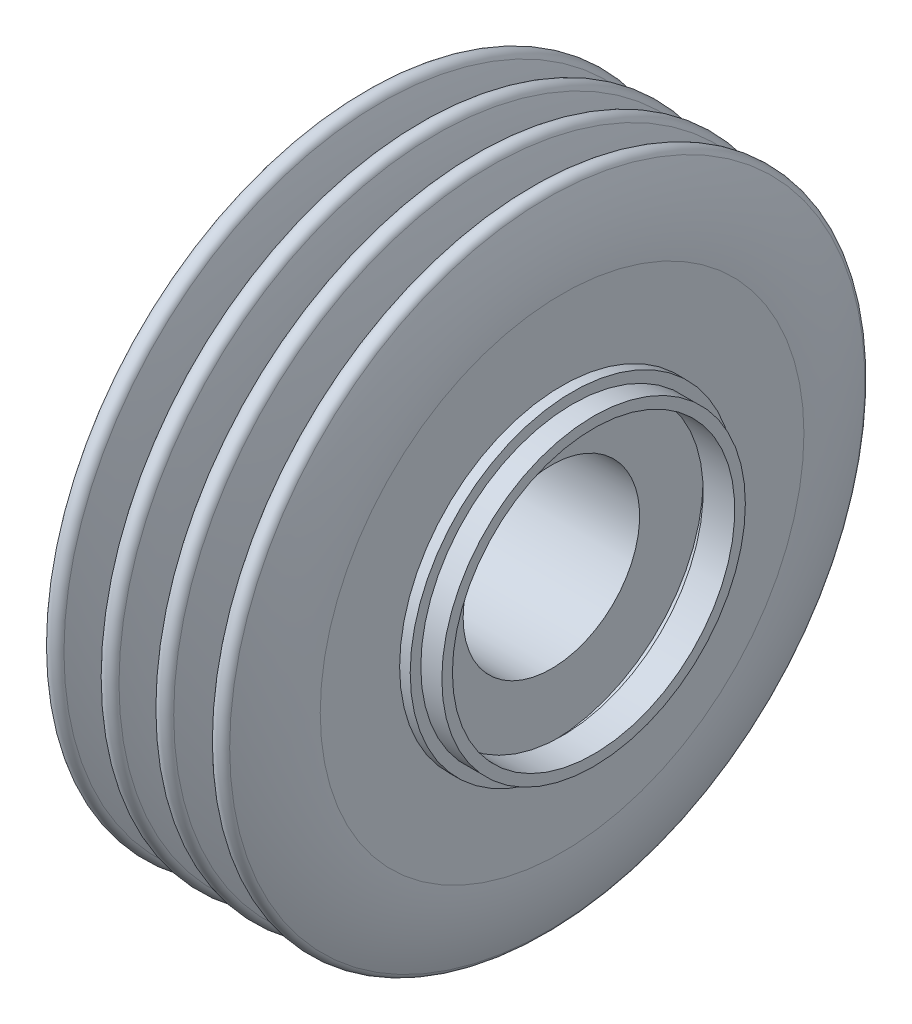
ISO-10303-21;
HEADER;
FILE_DESCRIPTION(('STEP AP214'),'2;1');
FILE_NAME('part.step','',(''),(''),'','','');
FILE_SCHEMA(('AUTOMOTIVE_DESIGN { 1 0 10303 214 1 1 1 1 }'));
ENDSEC;
DATA;
#1=APPLICATION_CONTEXT('core data for automotive mechanical design processes');
#2=APPLICATION_PROTOCOL_DEFINITION('international standard','automotive_design',2000,#1);
#3=PRODUCT_CONTEXT('',#1,'mechanical');
#4=PRODUCT('Part','Part','',(#3));
#5=PRODUCT_RELATED_PRODUCT_CATEGORY('part','',(#4));
#6=PRODUCT_DEFINITION_FORMATION('','',#4);
#7=PRODUCT_DEFINITION_CONTEXT('part definition',#1,'design');
#8=PRODUCT_DEFINITION('design','',#6,#7);
#9=PRODUCT_DEFINITION_SHAPE('','',#8);
#10=(LENGTH_UNIT() NAMED_UNIT(*) SI_UNIT(.MILLI.,.METRE.));
#11=(NAMED_UNIT(*) PLANE_ANGLE_UNIT() SI_UNIT($,.RADIAN.));
#12=(NAMED_UNIT(*) SI_UNIT($,.STERADIAN.) SOLID_ANGLE_UNIT());
#13=UNCERTAINTY_MEASURE_WITH_UNIT(LENGTH_MEASURE(1.E-05),#10,'distance_accuracy_value','');
#14=(GEOMETRIC_REPRESENTATION_CONTEXT(3) GLOBAL_UNCERTAINTY_ASSIGNED_CONTEXT((#13)) GLOBAL_UNIT_ASSIGNED_CONTEXT((#10,
#11,#12)) REPRESENTATION_CONTEXT('',''));
#15=CARTESIAN_POINT('',(0.,0.,0.));
#16=DIRECTION('',(0.,0.,1.));
#17=DIRECTION('',(1.,0.,0.));
#18=AXIS2_PLACEMENT_3D('',#15,#16,#17);
#19=CARTESIAN_POINT('',(82.1513797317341,0.,0.));
#20=DIRECTION('',(1.,0.,0.));
#21=DIRECTION('',(0.,0.,-1.));
#22=AXIS2_PLACEMENT_3D('',#19,#20,#21);
#23=CONICAL_SURFACE('',#22,46.,1.56936773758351);
#24=CARTESIAN_POINT('',(82.1835509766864,0.,0.));
#25=DIRECTION('',(-1.,0.,0.));
#26=DIRECTION('',(0.,0.,1.));
#27=AXIS2_PLACEMENT_3D('',#24,#25,#26);
#28=CIRCLE('',#27,68.519575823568);
#29=CARTESIAN_POINT('',(82.1835509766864,0.,68.519575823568));
#30=VERTEX_POINT('',#29);
#31=EDGE_CURVE('E10',#30,#30,#28,.T.);
#32=ORIENTED_EDGE('',*,*,#31,.F.);
#33=EDGE_LOOP('',(#32));
#34=FACE_BOUND('',#33,.T.);
#35=CARTESIAN_POINT('',(82.1513797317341,0.,0.));
#36=DIRECTION('',(-1.,0.,0.));
#37=DIRECTION('',(0.,0.,1.));
#38=AXIS2_PLACEMENT_3D('',#35,#36,#37);
#39=CIRCLE('',#38,46.);
#40=CARTESIAN_POINT('',(82.1513797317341,0.,46.));
#41=VERTEX_POINT('',#40);
#42=EDGE_CURVE('E139',#41,#41,#39,.T.);
#43=ORIENTED_EDGE('',*,*,#42,.T.);
#44=EDGE_LOOP('',(#43));
#45=FACE_BOUND('',#44,.T.);
#46=ADVANCED_FACE('F33',(#34,#45),#23,.F.);
#47=CARTESIAN_POINT('',(25.5457134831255,0.,0.));
#48=DIRECTION('',(-1.,0.,0.));
#49=DIRECTION('',(0.,0.,1.));
#50=AXIS2_PLACEMENT_3D('',#47,#48,#49);
#51=TOROIDAL_SURFACE('',#50,68.5817409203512,56.6378716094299);
#52=CARTESIAN_POINT('',(77.9846516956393,0.,0.));
#53=DIRECTION('',(-1.,0.,0.));
#54=DIRECTION('',(0.,0.,1.));
#55=AXIS2_PLACEMENT_3D('',#52,#53,#54);
#56=CIRCLE('',#55,89.9828217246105);
#57=CARTESIAN_POINT('',(77.9846516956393,0.,89.9828217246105));
#58=VERTEX_POINT('',#57);
#59=EDGE_CURVE('E39',#58,#58,#56,.T.);
#60=ORIENTED_EDGE('',*,*,#59,.F.);
#61=EDGE_LOOP('',(#60));
#62=FACE_BOUND('',#61,.T.);
#63=ORIENTED_EDGE('',*,*,#31,.T.);
#64=EDGE_LOOP('',(#63));
#65=FACE_BOUND('',#64,.T.);
#66=ADVANCED_FACE('F192',(#62,#65),#51,.T.);
#67=CARTESIAN_POINT('',(75.6699929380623,0.,0.));
#68=DIRECTION('',(-1.,0.,0.));
#69=DIRECTION('',(0.,0.,1.));
#70=AXIS2_PLACEMENT_3D('',#67,#68,#69);
#71=TOROIDAL_SURFACE('',#70,89.0381763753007,2.50000000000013);
#72=CARTESIAN_POINT('',(73.2742645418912,0.,0.));
#73=DIRECTION('',(-1.,0.,0.));
#74=DIRECTION('',(0.,0.,1.));
#75=AXIS2_PLACEMENT_3D('',#72,#73,#74);
#76=CIRCLE('',#75,89.7526590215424);
#77=CARTESIAN_POINT('',(73.2742645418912,0.,89.7526590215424));
#78=VERTEX_POINT('',#77);
#79=EDGE_CURVE('E43',#78,#78,#76,.T.);
#80=ORIENTED_EDGE('',*,*,#79,.F.);
#81=EDGE_LOOP('',(#80));
#82=FACE_BOUND('',#81,.T.);
#83=ORIENTED_EDGE('',*,*,#59,.T.);
#84=EDGE_LOOP('',(#83));
#85=FACE_BOUND('',#84,.T.);
#86=ADVANCED_FACE('F197',(#82,#85),#71,.T.);
#87=CARTESIAN_POINT('',(211.270094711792,0.,0.));
#88=DIRECTION('',(-1.,0.,0.));
#89=DIRECTION('',(0.,0.,1.));
#90=AXIS2_PLACEMENT_3D('',#87,#88,#89);
#91=DEGENERATE_TOROIDAL_SURFACE('',#90,48.5978995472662,144.001956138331,.T.);
#92=ORIENTED_EDGE('',*,*,#79,.T.);
#93=EDGE_LOOP('',(#92));
#94=FACE_BOUND('',#93,.T.);
#95=CARTESIAN_POINT('',(68.6344424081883,0.,0.));
#96=DIRECTION('',(-1.,0.,0.));
#97=DIRECTION('',(0.,0.,1.));
#98=AXIS2_PLACEMENT_3D('',#95,#96,#97);
#99=CIRCLE('',#98,68.3876459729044);
#100=CARTESIAN_POINT('',(68.6344424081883,0.,68.3876459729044));
#101=VERTEX_POINT('',#100);
#102=EDGE_CURVE('E47',#101,#101,#99,.T.);
#103=ORIENTED_EDGE('',*,*,#102,.F.);
#104=EDGE_LOOP('',(#103));
#105=FACE_BOUND('',#104,.T.);
#106=ADVANCED_FACE('F202',(#94,#105),#91,.T.);
#107=CARTESIAN_POINT('',(67.6835509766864,0.,0.));
#108=DIRECTION('',(-1.,0.,0.));
#109=DIRECTION('',(0.,0.,1.));
#110=AXIS2_PLACEMENT_3D('',#107,#108,#109);
#111=TOROIDAL_SURFACE('',#110,68.519575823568,0.960000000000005);
#112=ORIENTED_EDGE('',*,*,#102,.T.);
#113=EDGE_LOOP('',(#112));
#114=FACE_BOUND('',#113,.T.);
#115=CARTESIAN_POINT('',(66.7274405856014,0.,0.));
#116=DIRECTION('',(-1.,0.,0.));
#117=DIRECTION('',(0.,0.,1.));
#118=AXIS2_PLACEMENT_3D('',#115,#116,#117);
#119=CIRCLE('',#118,68.4332455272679);
#120=CARTESIAN_POINT('',(66.7274405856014,0.,68.4332455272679));
#121=VERTEX_POINT('',#120);
#122=EDGE_CURVE('E52',#121,#121,#119,.T.);
#123=ORIENTED_EDGE('',*,*,#122,.F.);
#124=EDGE_LOOP('',(#123));
#125=FACE_BOUND('',#124,.T.);
#126=ADVANCED_FACE('F208',(#114,#125),#111,.F.);
#127=CARTESIAN_POINT('',(-20.3877574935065,0.,0.));
#128=DIRECTION('',(-1.,0.,0.));
#129=DIRECTION('',(0.,0.,1.));
#130=AXIS2_PLACEMENT_3D('',#127,#128,#129);
#131=DEGENERATE_TOROIDAL_SURFACE('',#130,60.5673328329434,87.4695965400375,.T.);
#132=CARTESIAN_POINT('',(62.0254751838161,0.,0.));
#133=DIRECTION('',(-1.,0.,0.));
#134=DIRECTION('',(0.,0.,1.));
#135=AXIS2_PLACEMENT_3D('',#132,#133,#134);
#136=CIRCLE('',#135,89.8758537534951);
#137=CARTESIAN_POINT('',(62.0254751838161,0.,89.8758537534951));
#138=VERTEX_POINT('',#137);
#139=EDGE_CURVE('E55',#138,#138,#136,.T.);
#140=ORIENTED_EDGE('',*,*,#139,.F.);
#141=EDGE_LOOP('',(#140));
#142=FACE_BOUND('',#141,.T.);
#143=ORIENTED_EDGE('',*,*,#122,.T.);
#144=EDGE_LOOP('',(#143));
#145=FACE_BOUND('',#144,.T.);
#146=ADVANCED_FACE('F212',(#142,#145),#131,.T.);
#147=CARTESIAN_POINT('',(59.6699929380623,0.,0.));
#148=DIRECTION('',(-1.,0.,0.));
#149=DIRECTION('',(0.,0.,1.));
#150=AXIS2_PLACEMENT_3D('',#147,#148,#149);
#151=TOROIDAL_SURFACE('',#150,89.0381763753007,2.50000000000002);
#152=ORIENTED_EDGE('',*,*,#139,.T.);
#153=EDGE_LOOP('',(#152));
#154=FACE_BOUND('',#153,.T.);
#155=CARTESIAN_POINT('',(57.4194058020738,0.,0.));
#156=DIRECTION('',(-1.,0.,0.));
#157=DIRECTION('',(0.,0.,1.));
#158=AXIS2_PLACEMENT_3D('',#155,#156,#157);
#159=CIRCLE('',#158,90.1266879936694);
#160=CARTESIAN_POINT('',(57.4194058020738,0.,90.1266879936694));
#161=VERTEX_POINT('',#160);
#162=EDGE_CURVE('E58',#161,#161,#159,.T.);
#163=ORIENTED_EDGE('',*,*,#162,.F.);
#164=EDGE_LOOP('',(#163));
#165=FACE_BOUND('',#164,.T.);
#166=ADVANCED_FACE('F216',(#154,#165),#151,.T.);
#167=CARTESIAN_POINT('',(112.772947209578,0.,0.));
#168=DIRECTION('',(-1.,0.,0.));
#169=DIRECTION('',(0.,0.,1.));
#170=AXIS2_PLACEMENT_3D('',#167,#168,#169);
#171=TOROIDAL_SURFACE('',#170,63.3545750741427,61.4878896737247);
#172=ORIENTED_EDGE('',*,*,#162,.T.);
#173=EDGE_LOOP('',(#172));
#174=FACE_BOUND('',#173,.T.);
#175=CARTESIAN_POINT('',(51.4957308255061,0.,0.));
#176=DIRECTION('',(-1.,0.,0.));
#177=DIRECTION('',(0.,0.,1.));
#178=AXIS2_PLACEMENT_3D('',#175,#176,#177);
#179=CIRCLE('',#178,68.4401752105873);
#180=CARTESIAN_POINT('',(51.4957308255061,0.,68.4401752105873));
#181=VERTEX_POINT('',#180);
#182=EDGE_CURVE('E61',#181,#181,#179,.T.);
#183=ORIENTED_EDGE('',*,*,#182,.F.);
#184=EDGE_LOOP('',(#183));
#185=FACE_BOUND('',#184,.T.);
#186=ADVANCED_FACE('F220',(#174,#185),#171,.T.);
#187=CARTESIAN_POINT('',(50.5390200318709,0.,0.));
#188=DIRECTION('',(-1.,0.,0.));
#189=DIRECTION('',(0.,0.,1.));
#190=AXIS2_PLACEMENT_3D('',#187,#188,#189);
#191=TOROIDAL_SURFACE('',#190,68.519575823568,0.959999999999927);
#192=CARTESIAN_POINT('',(49.5806472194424,0.,0.));
#193=DIRECTION('',(-1.,0.,0.));
#194=DIRECTION('',(0.,0.,1.));
#195=AXIS2_PLACEMENT_3D('',#192,#193,#194);
#196=CIRCLE('',#195,68.5754466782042);
#197=CARTESIAN_POINT('',(49.5806472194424,0.,68.5754466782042));
#198=VERTEX_POINT('',#197);
#199=EDGE_CURVE('E64',#198,#198,#196,.T.);
#200=ORIENTED_EDGE('',*,*,#199,.F.);
#201=EDGE_LOOP('',(#200));
#202=FACE_BOUND('',#201,.T.);
#203=ORIENTED_EDGE('',*,*,#182,.T.);
#204=EDGE_LOOP('',(#203));
#205=FACE_BOUND('',#204,.T.);
#206=ADVANCED_FACE('F224',(#202,#205),#191,.F.);
#207=CARTESIAN_POINT('',(-4.29981819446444,0.,0.));
#208=DIRECTION('',(-1.,0.,0.));
#209=DIRECTION('',(0.,0.,1.));
#210=AXIS2_PLACEMENT_3D('',#207,#208,#209);
#211=TOROIDAL_SURFACE('',#210,71.7165496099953,53.9719471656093);
#212=CARTESIAN_POINT('',(46.5241787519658,0.,0.));
#213=DIRECTION('',(-1.,0.,0.));
#214=DIRECTION('',(0.,0.,1.));
#215=AXIS2_PLACEMENT_3D('',#212,#213,#214);
#216=CIRCLE('',#215,89.8794903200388);
#217=CARTESIAN_POINT('',(46.5241787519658,0.,89.8794903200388));
#218=VERTEX_POINT('',#217);
#219=EDGE_CURVE('E67',#218,#218,#216,.T.);
#220=ORIENTED_EDGE('',*,*,#219,.F.);
#221=EDGE_LOOP('',(#220));
#222=FACE_BOUND('',#221,.T.);
#223=ORIENTED_EDGE('',*,*,#199,.T.);
#224=EDGE_LOOP('',(#223));
#225=FACE_BOUND('',#224,.T.);
#226=ADVANCED_FACE('F228',(#222,#225),#211,.T.);
#227=CARTESIAN_POINT('',(44.1699929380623,0.,0.));
#228=DIRECTION('',(-1.,0.,0.));
#229=DIRECTION('',(0.,0.,1.));
#230=AXIS2_PLACEMENT_3D('',#227,#228,#229);
#231=TOROIDAL_SURFACE('',#230,89.0381763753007,2.49999999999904);
#232=CARTESIAN_POINT('',(41.8852009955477,0.,0.));
#233=DIRECTION('',(-1.,0.,0.));
#234=DIRECTION('',(0.,0.,1.));
#235=AXIS2_PLACEMENT_3D('',#232,#233,#234);
#236=CIRCLE('',#235,90.0529304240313);
#237=CARTESIAN_POINT('',(41.8852009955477,0.,90.0529304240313));
#238=VERTEX_POINT('',#237);
#239=EDGE_CURVE('E70',#238,#238,#236,.T.);
#240=ORIENTED_EDGE('',*,*,#239,.F.);
#241=EDGE_LOOP('',(#240));
#242=FACE_BOUND('',#241,.T.);
#243=ORIENTED_EDGE('',*,*,#219,.T.);
#244=EDGE_LOOP('',(#243));
#245=FACE_BOUND('',#244,.T.);
#246=ADVANCED_FACE('F232',(#242,#245),#231,.T.);
#247=CARTESIAN_POINT('',(95.7534544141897,0.,0.));
#248=DIRECTION('',(-1.,0.,0.));
#249=DIRECTION('',(0.,0.,1.));
#250=AXIS2_PLACEMENT_3D('',#247,#248,#249);
#251=TOROIDAL_SURFACE('',#250,66.1282013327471,58.9421868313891);
#252=ORIENTED_EDGE('',*,*,#239,.T.);
#253=EDGE_LOOP('',(#252));
#254=FACE_BOUND('',#253,.T.);
#255=CARTESIAN_POINT('',(36.8582547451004,0.,0.));
#256=DIRECTION('',(-1.,0.,0.));
#257=DIRECTION('',(0.,0.,1.));
#258=AXIS2_PLACEMENT_3D('',#255,#256,#257);
#259=CIRCLE('',#258,68.4812513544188);
#260=CARTESIAN_POINT('',(36.8582547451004,0.,68.4812513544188));
#261=VERTEX_POINT('',#260);
#262=EDGE_CURVE('E73',#261,#261,#259,.T.);
#263=ORIENTED_EDGE('',*,*,#262,.F.);
#264=EDGE_LOOP('',(#263));
#265=FACE_BOUND('',#264,.T.);
#266=ADVANCED_FACE('F236',(#254,#265),#251,.T.);
#267=CARTESIAN_POINT('',(35.8990200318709,0.,0.));
#268=DIRECTION('',(-1.,0.,0.));
#269=DIRECTION('',(0.,0.,1.));
#270=AXIS2_PLACEMENT_3D('',#267,#268,#269);
#271=TOROIDAL_SURFACE('',#270,68.519575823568,0.96000000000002);
#272=ORIENTED_EDGE('',*,*,#262,.T.);
#273=EDGE_LOOP('',(#272));
#274=FACE_BOUND('',#273,.T.);
#275=CARTESIAN_POINT('',(34.9390436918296,0.,0.));
#276=DIRECTION('',(-1.,0.,0.));
#277=DIRECTION('',(0.,0.,1.));
#278=AXIS2_PLACEMENT_3D('',#275,#276,#277);
#279=CIRCLE('',#278,68.5263157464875);
#280=CARTESIAN_POINT('',(34.9390436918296,0.,68.5263157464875));
#281=VERTEX_POINT('',#280);
#282=EDGE_CURVE('E76',#281,#281,#279,.T.);
#283=ORIENTED_EDGE('',*,*,#282,.F.);
#284=EDGE_LOOP('',(#283));
#285=FACE_BOUND('',#284,.T.);
#286=ADVANCED_FACE('F240',(#274,#285),#271,.F.);
#287=CARTESIAN_POINT('',(-23.0455285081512,0.,0.));
#288=DIRECTION('',(-1.,0.,0.));
#289=DIRECTION('',(0.,0.,1.));
#290=AXIS2_PLACEMENT_3D('',#287,#288,#289);
#291=TOROIDAL_SURFACE('',#290,68.9334211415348,57.9860013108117);
#292=CARTESIAN_POINT('',(31.0001086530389,0.,0.));
#293=DIRECTION('',(-1.,0.,0.));
#294=DIRECTION('',(0.,0.,1.));
#295=AXIS2_PLACEMENT_3D('',#292,#293,#294);
#296=CIRCLE('',#295,89.9440244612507);
#297=CARTESIAN_POINT('',(31.0001086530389,0.,89.9440244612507));
#298=VERTEX_POINT('',#297);
#299=EDGE_CURVE('E79',#298,#298,#296,.T.);
#300=ORIENTED_EDGE('',*,*,#299,.F.);
#301=EDGE_LOOP('',(#300));
#302=FACE_BOUND('',#301,.T.);
#303=ORIENTED_EDGE('',*,*,#282,.T.);
#304=EDGE_LOOP('',(#303));
#305=FACE_BOUND('',#304,.T.);
#306=ADVANCED_FACE('F244',(#302,#305),#291,.T.);
#307=CARTESIAN_POINT('',(28.6699929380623,0.,0.));
#308=DIRECTION('',(-1.,0.,0.));
#309=DIRECTION('',(0.,0.,1.));
#310=AXIS2_PLACEMENT_3D('',#307,#308,#309);
#311=TOROIDAL_SURFACE('',#310,89.0381763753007,2.50000000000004);
#312=ORIENTED_EDGE('',*,*,#299,.T.);
#313=EDGE_LOOP('',(#312));
#314=FACE_BOUND('',#313,.T.);
#315=CARTESIAN_POINT('',(26.403669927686,0.,0.));
#316=DIRECTION('',(-1.,0.,0.));
#317=DIRECTION('',(0.,0.,1.));
#318=AXIS2_PLACEMENT_3D('',#315,#316,#317);
#319=CIRCLE('',#318,90.0935341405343);
#320=CARTESIAN_POINT('',(26.403669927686,0.,90.0935341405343));
#321=VERTEX_POINT('',#320);
#322=EDGE_CURVE('E82',#321,#321,#319,.T.);
#323=ORIENTED_EDGE('',*,*,#322,.F.);
#324=EDGE_LOOP('',(#323));
#325=FACE_BOUND('',#324,.T.);
#326=ADVANCED_FACE('F248',(#314,#325),#311,.T.);
#327=CARTESIAN_POINT('',(76.5523882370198,0.,0.));
#328=DIRECTION('',(-1.,0.,0.));
#329=DIRECTION('',(0.,0.,1.));
#330=AXIS2_PLACEMENT_3D('',#327,#328,#329);
#331=TOROIDAL_SURFACE('',#330,66.7407997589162,55.3194735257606);
#332=ORIENTED_EDGE('',*,*,#322,.T.);
#333=EDGE_LOOP('',(#332));
#334=FACE_BOUND('',#333,.T.);
#335=CARTESIAN_POINT('',(21.2615200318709,0.,0.));
#336=DIRECTION('',(-1.,0.,0.));
#337=DIRECTION('',(0.,0.,1.));
#338=AXIS2_PLACEMENT_3D('',#335,#336,#337);
#339=CIRCLE('',#338,68.519575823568);
#340=CARTESIAN_POINT('',(21.2615200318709,0.,68.519575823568));
#341=VERTEX_POINT('',#340);
#342=EDGE_CURVE('E85',#341,#341,#339,.T.);
#343=ORIENTED_EDGE('',*,*,#342,.F.);
#344=EDGE_LOOP('',(#343));
#345=FACE_BOUND('',#344,.T.);
#346=ADVANCED_FACE('F252',(#334,#345),#331,.T.);
#347=CARTESIAN_POINT('',(20.6013797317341,0.,0.));
#348=DIRECTION('',(1.,0.,0.));
#349=DIRECTION('',(0.,0.,-1.));
#350=AXIS2_PLACEMENT_3D('',#347,#348,#349);
#351=CONICAL_SURFACE('',#350,48.,1.5386361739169);
#352=ORIENTED_EDGE('',*,*,#342,.T.);
#353=EDGE_LOOP('',(#352));
#354=FACE_BOUND('',#353,.T.);
#355=CARTESIAN_POINT('',(20.6013797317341,0.,0.));
#356=DIRECTION('',(-1.,0.,0.));
#357=DIRECTION('',(0.,0.,1.));
#358=AXIS2_PLACEMENT_3D('',#355,#356,#357);
#359=CIRCLE('',#358,48.);
#360=CARTESIAN_POINT('',(20.6013797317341,0.,48.));
#361=VERTEX_POINT('',#360);
#362=EDGE_CURVE('E88',#361,#361,#359,.T.);
#363=ORIENTED_EDGE('',*,*,#362,.F.);
#364=EDGE_LOOP('',(#363));
#365=FACE_BOUND('',#364,.T.);
#366=ADVANCED_FACE('F256',(#354,#365),#351,.T.);
#367=CARTESIAN_POINT('',(0.,0.,0.));
#368=DIRECTION('',(-1.,0.,0.));
#369=DIRECTION('',(0.,0.,1.));
#370=AXIS2_PLACEMENT_3D('',#367,#368,#369);
#371=CYLINDRICAL_SURFACE('',#370,48.);
#372=CARTESIAN_POINT('',(14.6013797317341,0.,0.));
#373=DIRECTION('',(-1.,0.,0.));
#374=DIRECTION('',(0.,0.,1.));
#375=AXIS2_PLACEMENT_3D('',#372,#373,#374);
#376=CIRCLE('',#375,48.);
#377=CARTESIAN_POINT('',(14.6013797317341,0.,48.));
#378=VERTEX_POINT('',#377);
#379=EDGE_CURVE('E91',#378,#378,#376,.T.);
#380=ORIENTED_EDGE('',*,*,#379,.F.);
#381=EDGE_LOOP('',(#380));
#382=FACE_BOUND('',#381,.T.);
#383=ORIENTED_EDGE('',*,*,#362,.T.);
#384=EDGE_LOOP('',(#383));
#385=FACE_BOUND('',#384,.T.);
#386=ADVANCED_FACE('F260',(#382,#385),#371,.T.);
#387=CARTESIAN_POINT('',(14.6013797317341,-46.4321800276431,0.));
#388=DIRECTION('',(1.,0.,0.));
#389=DIRECTION('',(0.,0.,-1.));
#390=AXIS2_PLACEMENT_3D('',#387,#388,#389);
#391=PLANE('',#390);
#392=CARTESIAN_POINT('',(14.6013797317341,0.,0.));
#393=DIRECTION('',(-1.,0.,0.));
#394=DIRECTION('',(0.,0.,1.));
#395=AXIS2_PLACEMENT_3D('',#392,#393,#394);
#396=CIRCLE('',#395,46.);
#397=CARTESIAN_POINT('',(14.6013797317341,0.,46.));
#398=VERTEX_POINT('',#397);
#399=EDGE_CURVE('E94',#398,#398,#396,.T.);
#400=ORIENTED_EDGE('',*,*,#399,.F.);
#401=EDGE_LOOP('',(#400));
#402=FACE_BOUND('',#401,.T.);
#403=ORIENTED_EDGE('',*,*,#379,.T.);
#404=EDGE_LOOP('',(#403));
#405=FACE_BOUND('',#404,.T.);
#406=ADVANCED_FACE('F264',(#402,#405),#391,.F.);
#407=CARTESIAN_POINT('',(0.,0.,0.));
#408=DIRECTION('',(-1.,0.,0.));
#409=DIRECTION('',(0.,0.,1.));
#410=AXIS2_PLACEMENT_3D('',#407,#408,#409);
#411=CYLINDRICAL_SURFACE('',#410,46.);
#412=CARTESIAN_POINT('',(7.60137973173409,0.,0.));
#413=DIRECTION('',(-1.,0.,0.));
#414=DIRECTION('',(0.,0.,1.));
#415=AXIS2_PLACEMENT_3D('',#412,#413,#414);
#416=CIRCLE('',#415,46.);
#417=CARTESIAN_POINT('',(7.60137973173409,0.,46.));
#418=VERTEX_POINT('',#417);
#419=EDGE_CURVE('E97',#418,#418,#416,.T.);
#420=ORIENTED_EDGE('',*,*,#419,.F.);
#421=EDGE_LOOP('',(#420));
#422=FACE_BOUND('',#421,.T.);
#423=ORIENTED_EDGE('',*,*,#399,.T.);
#424=EDGE_LOOP('',(#423));
#425=FACE_BOUND('',#424,.T.);
#426=ADVANCED_FACE('F268',(#422,#425),#411,.T.);
#427=CARTESIAN_POINT('',(7.60137973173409,-46.4321800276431,0.));
#428=DIRECTION('',(1.,0.,0.));
#429=DIRECTION('',(0.,0.,-1.));
#430=AXIS2_PLACEMENT_3D('',#427,#428,#429);
#431=PLANE('',#430);
#432=CARTESIAN_POINT('',(7.60137973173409,0.,0.));
#433=DIRECTION('',(-1.,0.,0.));
#434=DIRECTION('',(0.,0.,1.));
#435=AXIS2_PLACEMENT_3D('',#432,#433,#434);
#436=CIRCLE('',#435,43.);
#437=CARTESIAN_POINT('',(7.60137973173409,0.,43.));
#438=VERTEX_POINT('',#437);
#439=EDGE_CURVE('E100',#438,#438,#436,.T.);
#440=ORIENTED_EDGE('',*,*,#439,.F.);
#441=EDGE_LOOP('',(#440));
#442=FACE_BOUND('',#441,.T.);
#443=ORIENTED_EDGE('',*,*,#419,.T.);
#444=EDGE_LOOP('',(#443));
#445=FACE_BOUND('',#444,.T.);
#446=ADVANCED_FACE('F272',(#442,#445),#431,.F.);
#447=CARTESIAN_POINT('',(0.,0.,0.));
#448=DIRECTION('',(-1.,0.,0.));
#449=DIRECTION('',(0.,0.,1.));
#450=AXIS2_PLACEMENT_3D('',#447,#448,#449);
#451=CYLINDRICAL_SURFACE('',#450,43.);
#452=CARTESIAN_POINT('',(17.6013797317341,0.,0.));
#453=DIRECTION('',(-1.,0.,0.));
#454=DIRECTION('',(0.,0.,1.));
#455=AXIS2_PLACEMENT_3D('',#452,#453,#454);
#456=CIRCLE('',#455,43.);
#457=CARTESIAN_POINT('',(17.6013797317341,0.,43.));
#458=VERTEX_POINT('',#457);
#459=EDGE_CURVE('E103',#458,#458,#456,.T.);
#460=ORIENTED_EDGE('',*,*,#459,.F.);
#461=EDGE_LOOP('',(#460));
#462=FACE_BOUND('',#461,.T.);
#463=ORIENTED_EDGE('',*,*,#439,.T.);
#464=EDGE_LOOP('',(#463));
#465=FACE_BOUND('',#464,.T.);
#466=ADVANCED_FACE('F276',(#462,#465),#451,.F.);
#467=CARTESIAN_POINT('',(17.6013797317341,-46.4321800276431,0.));
#468=DIRECTION('',(-1.,0.,0.));
#469=DIRECTION('',(0.,0.,1.));
#470=AXIS2_PLACEMENT_3D('',#467,#468,#469);
#471=PLANE('',#470);
#472=CARTESIAN_POINT('',(17.6013797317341,0.,0.));
#473=DIRECTION('',(-1.,0.,0.));
#474=DIRECTION('',(0.,0.,1.));
#475=AXIS2_PLACEMENT_3D('',#472,#473,#474);
#476=CIRCLE('',#475,45.);
#477=CARTESIAN_POINT('',(17.6013797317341,0.,45.));
#478=VERTEX_POINT('',#477);
#479=EDGE_CURVE('E106',#478,#478,#476,.T.);
#480=ORIENTED_EDGE('',*,*,#479,.F.);
#481=EDGE_LOOP('',(#480));
#482=FACE_BOUND('',#481,.T.);
#483=ORIENTED_EDGE('',*,*,#459,.T.);
#484=EDGE_LOOP('',(#483));
#485=FACE_BOUND('',#484,.T.);
#486=ADVANCED_FACE('F280',(#482,#485),#471,.F.);
#487=CARTESIAN_POINT('',(0.,0.,0.));
#488=DIRECTION('',(-1.,0.,0.));
#489=DIRECTION('',(0.,0.,1.));
#490=AXIS2_PLACEMENT_3D('',#487,#488,#489);
#491=CYLINDRICAL_SURFACE('',#490,45.);
#492=CARTESIAN_POINT('',(20.6013797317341,0.,0.));
#493=DIRECTION('',(-1.,0.,0.));
#494=DIRECTION('',(0.,0.,1.));
#495=AXIS2_PLACEMENT_3D('',#492,#493,#494);
#496=CIRCLE('',#495,45.);
#497=CARTESIAN_POINT('',(20.6013797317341,0.,45.));
#498=VERTEX_POINT('',#497);
#499=EDGE_CURVE('E109',#498,#498,#496,.T.);
#500=ORIENTED_EDGE('',*,*,#499,.F.);
#501=EDGE_LOOP('',(#500));
#502=FACE_BOUND('',#501,.T.);
#503=ORIENTED_EDGE('',*,*,#479,.T.);
#504=EDGE_LOOP('',(#503));
#505=FACE_BOUND('',#504,.T.);
#506=ADVANCED_FACE('F284',(#502,#505),#491,.F.);
#507=CARTESIAN_POINT('',(20.6013797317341,-46.4321800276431,0.));
#508=DIRECTION('',(1.,0.,0.));
#509=DIRECTION('',(0.,0.,-1.));
#510=AXIS2_PLACEMENT_3D('',#507,#508,#509);
#511=PLANE('',#510);
#512=CARTESIAN_POINT('',(20.6013797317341,0.,0.));
#513=DIRECTION('',(-1.,0.,0.));
#514=DIRECTION('',(0.,0.,1.));
#515=AXIS2_PLACEMENT_3D('',#512,#513,#514);
#516=CIRCLE('',#515,25.);
#517=CARTESIAN_POINT('',(20.6013797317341,0.,25.));
#518=VERTEX_POINT('',#517);
#519=EDGE_CURVE('E112',#518,#518,#516,.T.);
#520=ORIENTED_EDGE('',*,*,#519,.F.);
#521=EDGE_LOOP('',(#520));
#522=FACE_BOUND('',#521,.T.);
#523=ORIENTED_EDGE('',*,*,#499,.T.);
#524=EDGE_LOOP('',(#523));
#525=FACE_BOUND('',#524,.T.);
#526=ADVANCED_FACE('F288',(#522,#525),#511,.F.);
#527=CARTESIAN_POINT('',(0.,0.,0.));
#528=DIRECTION('',(-1.,0.,0.));
#529=DIRECTION('',(0.,0.,1.));
#530=AXIS2_PLACEMENT_3D('',#527,#528,#529);
#531=CYLINDRICAL_SURFACE('',#530,25.);
#532=CARTESIAN_POINT('',(79.1513797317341,0.,0.));
#533=DIRECTION('',(-1.,0.,0.));
#534=DIRECTION('',(0.,0.,1.));
#535=AXIS2_PLACEMENT_3D('',#532,#533,#534);
#536=CIRCLE('',#535,25.);
#537=CARTESIAN_POINT('',(79.1513797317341,0.,25.));
#538=VERTEX_POINT('',#537);
#539=EDGE_CURVE('E115',#538,#538,#536,.T.);
#540=ORIENTED_EDGE('',*,*,#539,.F.);
#541=EDGE_LOOP('',(#540));
#542=FACE_BOUND('',#541,.T.);
#543=ORIENTED_EDGE('',*,*,#519,.T.);
#544=EDGE_LOOP('',(#543));
#545=FACE_BOUND('',#544,.T.);
#546=ADVANCED_FACE('F188',(#542,#545),#531,.F.);
#547=CARTESIAN_POINT('',(79.1513797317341,-46.4321800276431,0.));
#548=DIRECTION('',(1.,0.,0.));
#549=DIRECTION('',(0.,0.,-1.));
#550=AXIS2_PLACEMENT_3D('',#547,#548,#549);
#551=PLANE('',#550);
#552=ORIENTED_EDGE('',*,*,#539,.T.);
#553=EDGE_LOOP('',(#552));
#554=FACE_BOUND('',#553,.T.);
#555=CARTESIAN_POINT('',(79.1513797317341,0.,0.));
#556=DIRECTION('',(-1.,0.,0.));
#557=DIRECTION('',(0.,0.,1.));
#558=AXIS2_PLACEMENT_3D('',#555,#556,#557);
#559=CIRCLE('',#558,43.);
#560=CARTESIAN_POINT('',(79.1513797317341,0.,43.));
#561=VERTEX_POINT('',#560);
#562=EDGE_CURVE('E118',#561,#561,#559,.T.);
#563=ORIENTED_EDGE('',*,*,#562,.F.);
#564=EDGE_LOOP('',(#563));
#565=FACE_BOUND('',#564,.T.);
#566=ADVANCED_FACE('F182',(#554,#565),#551,.T.);
#567=CARTESIAN_POINT('',(0.,0.,0.));
#568=DIRECTION('',(-1.,0.,0.));
#569=DIRECTION('',(0.,0.,1.));
#570=AXIS2_PLACEMENT_3D('',#567,#568,#569);
#571=CYLINDRICAL_SURFACE('',#570,43.);
#572=ORIENTED_EDGE('',*,*,#562,.T.);
#573=EDGE_LOOP('',(#572));
#574=FACE_BOUND('',#573,.T.);
#575=CARTESIAN_POINT('',(82.1513797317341,0.,0.));
#576=DIRECTION('',(-1.,0.,0.));
#577=DIRECTION('',(0.,0.,1.));
#578=AXIS2_PLACEMENT_3D('',#575,#576,#577);
#579=CIRCLE('',#578,43.);
#580=CARTESIAN_POINT('',(82.1513797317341,0.,43.));
#581=VERTEX_POINT('',#580);
#582=EDGE_CURVE('E121',#581,#581,#579,.T.);
#583=ORIENTED_EDGE('',*,*,#582,.F.);
#584=EDGE_LOOP('',(#583));
#585=FACE_BOUND('',#584,.T.);
#586=ADVANCED_FACE('F177',(#574,#585),#571,.F.);
#587=CARTESIAN_POINT('',(82.1513797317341,-46.4321800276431,0.));
#588=DIRECTION('',(1.,0.,0.));
#589=DIRECTION('',(0.,0.,-1.));
#590=AXIS2_PLACEMENT_3D('',#587,#588,#589);
#591=PLANE('',#590);
#592=CARTESIAN_POINT('',(82.1513797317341,0.,0.));
#593=DIRECTION('',(-1.,0.,0.));
#594=DIRECTION('',(0.,0.,1.));
#595=AXIS2_PLACEMENT_3D('',#592,#593,#594);
#596=CIRCLE('',#595,40.);
#597=CARTESIAN_POINT('',(82.1513797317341,0.,40.));
#598=VERTEX_POINT('',#597);
#599=EDGE_CURVE('E124',#598,#598,#596,.T.);
#600=ORIENTED_EDGE('',*,*,#599,.F.);
#601=EDGE_LOOP('',(#600));
#602=FACE_BOUND('',#601,.T.);
#603=ORIENTED_EDGE('',*,*,#582,.T.);
#604=EDGE_LOOP('',(#603));
#605=FACE_BOUND('',#604,.T.);
#606=ADVANCED_FACE('F171',(#602,#605),#591,.F.);
#607=CARTESIAN_POINT('',(0.,0.,0.));
#608=DIRECTION('',(-1.,0.,0.));
#609=DIRECTION('',(0.,0.,1.));
#610=AXIS2_PLACEMENT_3D('',#607,#608,#609);
#611=CYLINDRICAL_SURFACE('',#610,40.);
#612=CARTESIAN_POINT('',(91.1113797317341,0.,0.));
#613=DIRECTION('',(-1.,0.,0.));
#614=DIRECTION('',(0.,0.,1.));
#615=AXIS2_PLACEMENT_3D('',#612,#613,#614);
#616=CIRCLE('',#615,40.);
#617=CARTESIAN_POINT('',(91.1113797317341,0.,40.));
#618=VERTEX_POINT('',#617);
#619=EDGE_CURVE('E127',#618,#618,#616,.T.);
#620=ORIENTED_EDGE('',*,*,#619,.F.);
#621=EDGE_LOOP('',(#620));
#622=FACE_BOUND('',#621,.T.);
#623=ORIENTED_EDGE('',*,*,#599,.T.);
#624=EDGE_LOOP('',(#623));
#625=FACE_BOUND('',#624,.T.);
#626=ADVANCED_FACE('F165',(#622,#625),#611,.F.);
#627=CARTESIAN_POINT('',(91.1113797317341,-46.4321800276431,0.));
#628=DIRECTION('',(-1.,0.,0.));
#629=DIRECTION('',(0.,0.,1.));
#630=AXIS2_PLACEMENT_3D('',#627,#628,#629);
#631=PLANE('',#630);
#632=CARTESIAN_POINT('',(91.1113797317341,0.,0.));
#633=DIRECTION('',(-1.,0.,0.));
#634=DIRECTION('',(0.,0.,1.));
#635=AXIS2_PLACEMENT_3D('',#632,#633,#634);
#636=CIRCLE('',#635,43.);
#637=CARTESIAN_POINT('',(91.1113797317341,0.,43.));
#638=VERTEX_POINT('',#637);
#639=EDGE_CURVE('E130',#638,#638,#636,.T.);
#640=ORIENTED_EDGE('',*,*,#639,.F.);
#641=EDGE_LOOP('',(#640));
#642=FACE_BOUND('',#641,.T.);
#643=ORIENTED_EDGE('',*,*,#619,.T.);
#644=EDGE_LOOP('',(#643));
#645=FACE_BOUND('',#644,.T.);
#646=ADVANCED_FACE('F159',(#642,#645),#631,.F.);
#647=CARTESIAN_POINT('',(0.,0.,0.));
#648=DIRECTION('',(-1.,0.,0.));
#649=DIRECTION('',(0.,0.,1.));
#650=AXIS2_PLACEMENT_3D('',#647,#648,#649);
#651=CYLINDRICAL_SURFACE('',#650,43.);
#652=CARTESIAN_POINT('',(85.1513797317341,0.,0.));
#653=DIRECTION('',(-1.,0.,0.));
#654=DIRECTION('',(0.,0.,1.));
#655=AXIS2_PLACEMENT_3D('',#652,#653,#654);
#656=CIRCLE('',#655,43.);
#657=CARTESIAN_POINT('',(85.1513797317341,0.,43.));
#658=VERTEX_POINT('',#657);
#659=EDGE_CURVE('E133',#658,#658,#656,.T.);
#660=ORIENTED_EDGE('',*,*,#659,.F.);
#661=EDGE_LOOP('',(#660));
#662=FACE_BOUND('',#661,.T.);
#663=ORIENTED_EDGE('',*,*,#639,.T.);
#664=EDGE_LOOP('',(#663));
#665=FACE_BOUND('',#664,.T.);
#666=ADVANCED_FACE('F153',(#662,#665),#651,.T.);
#667=CARTESIAN_POINT('',(85.1513797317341,-46.4321800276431,0.));
#668=DIRECTION('',(-1.,0.,0.));
#669=DIRECTION('',(0.,0.,1.));
#670=AXIS2_PLACEMENT_3D('',#667,#668,#669);
#671=PLANE('',#670);
#672=CARTESIAN_POINT('',(85.1513797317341,0.,0.));
#673=DIRECTION('',(-1.,0.,0.));
#674=DIRECTION('',(0.,0.,1.));
#675=AXIS2_PLACEMENT_3D('',#672,#673,#674);
#676=CIRCLE('',#675,46.);
#677=CARTESIAN_POINT('',(85.1513797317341,0.,46.));
#678=VERTEX_POINT('',#677);
#679=EDGE_CURVE('E136',#678,#678,#676,.T.);
#680=ORIENTED_EDGE('',*,*,#679,.F.);
#681=EDGE_LOOP('',(#680));
#682=FACE_BOUND('',#681,.T.);
#683=ORIENTED_EDGE('',*,*,#659,.T.);
#684=EDGE_LOOP('',(#683));
#685=FACE_BOUND('',#684,.T.);
#686=ADVANCED_FACE('F147',(#682,#685),#671,.F.);
#687=CARTESIAN_POINT('',(0.,0.,0.));
#688=DIRECTION('',(-1.,0.,0.));
#689=DIRECTION('',(0.,0.,1.));
#690=AXIS2_PLACEMENT_3D('',#687,#688,#689);
#691=CYLINDRICAL_SURFACE('',#690,46.);
#692=ORIENTED_EDGE('',*,*,#42,.F.);
#693=EDGE_LOOP('',(#692));
#694=FACE_BOUND('',#693,.T.);
#695=ORIENTED_EDGE('',*,*,#679,.T.);
#696=EDGE_LOOP('',(#695));
#697=FACE_BOUND('',#696,.T.);
#698=ADVANCED_FACE('F144',(#694,#697),#691,.T.);
#699=CLOSED_SHELL('',(#46,#66,#86,#106,#126,#146,#166,#186,#206,#226,#246,#266,#286,#306,#326,
#346,#366,#386,#406,#426,#446,#466,#486,#506,#526,#546,#566,#586,#606,#626,#646,#666,#686,#698));
#700=MANIFOLD_SOLID_BREP('B2',#699);
#701=ADVANCED_BREP_SHAPE_REPRESENTATION('',(#18,#700),#14);
#702=SHAPE_DEFINITION_REPRESENTATION(#9,#701);
ENDSEC;
END-ISO-10303-21;
